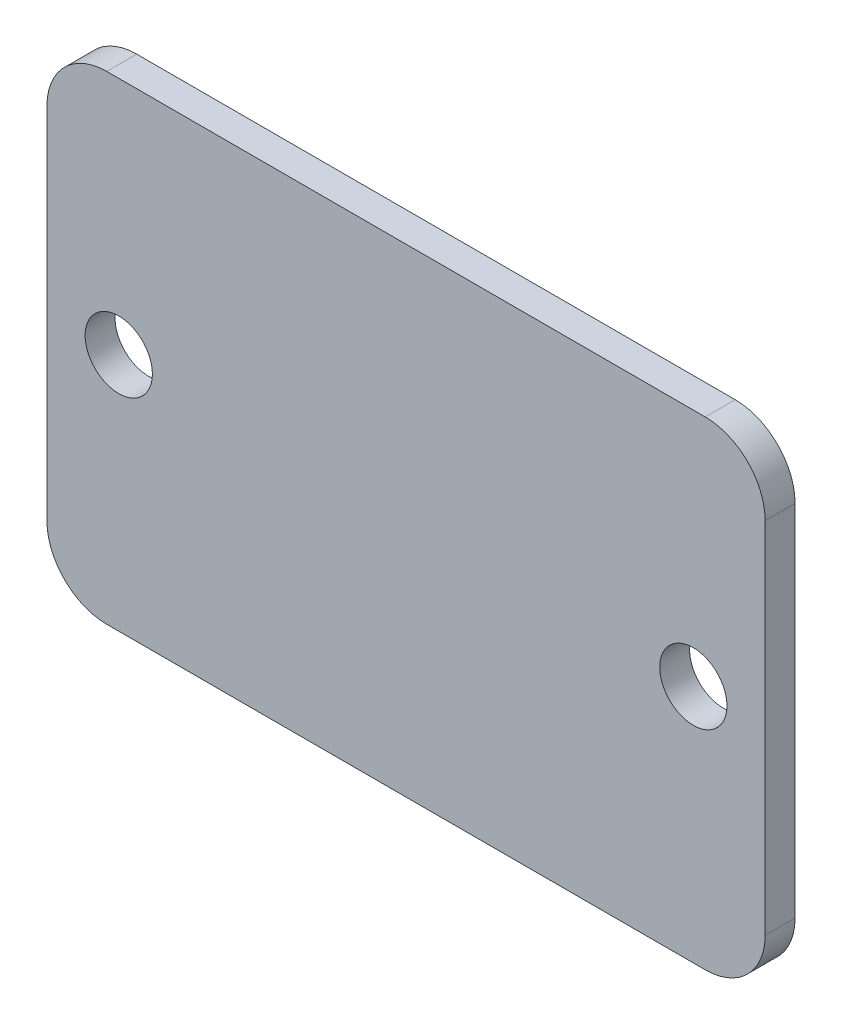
ISO-10303-21;
HEADER;
FILE_DESCRIPTION(('STEP AP214'),'2;1');
FILE_NAME('part.step','',(''),(''),'','','');
FILE_SCHEMA(('AUTOMOTIVE_DESIGN { 1 0 10303 214 1 1 1 1 }'));
ENDSEC;
DATA;
#1=APPLICATION_CONTEXT('core data for automotive mechanical design processes');
#2=APPLICATION_PROTOCOL_DEFINITION('international standard','automotive_design',2000,#1);
#3=PRODUCT_CONTEXT('',#1,'mechanical');
#4=PRODUCT('Part','Part','',(#3));
#5=PRODUCT_RELATED_PRODUCT_CATEGORY('part','',(#4));
#6=PRODUCT_DEFINITION_FORMATION('','',#4);
#7=PRODUCT_DEFINITION_CONTEXT('part definition',#1,'design');
#8=PRODUCT_DEFINITION('design','',#6,#7);
#9=PRODUCT_DEFINITION_SHAPE('','',#8);
#10=(LENGTH_UNIT() NAMED_UNIT(*) SI_UNIT(.MILLI.,.METRE.));
#11=(NAMED_UNIT(*) PLANE_ANGLE_UNIT() SI_UNIT($,.RADIAN.));
#12=(NAMED_UNIT(*) SI_UNIT($,.STERADIAN.) SOLID_ANGLE_UNIT());
#13=UNCERTAINTY_MEASURE_WITH_UNIT(LENGTH_MEASURE(1.E-05),#10,'distance_accuracy_value','');
#14=(GEOMETRIC_REPRESENTATION_CONTEXT(3) GLOBAL_UNCERTAINTY_ASSIGNED_CONTEXT((#13)) GLOBAL_UNIT_ASSIGNED_CONTEXT((#10,
#11,#12)) REPRESENTATION_CONTEXT('',''));
#15=CARTESIAN_POINT('',(0.,0.,0.));
#16=DIRECTION('',(0.,0.,1.));
#17=DIRECTION('',(1.,0.,0.));
#18=AXIS2_PLACEMENT_3D('',#15,#16,#17);
#19=CARTESIAN_POINT('',(-120.65,-132.08,0.));
#20=DIRECTION('',(0.,0.,-1.));
#21=DIRECTION('',(-1.,0.,0.));
#22=AXIS2_PLACEMENT_3D('',#19,#20,#21);
#23=PLANE('',#22);
#24=CARTESIAN_POINT('',(-182.88,-151.13,0.));
#25=DIRECTION('',(0.,0.,1.));
#26=DIRECTION('',(1.,0.,0.));
#27=AXIS2_PLACEMENT_3D('',#24,#25,#26);
#28=CIRCLE('',#27,3.5687);
#29=CARTESIAN_POINT('',(-179.3113,-151.13,0.));
#30=VERTEX_POINT('',#29);
#31=EDGE_CURVE('E228',#30,#30,#28,.T.);
#32=ORIENTED_EDGE('',*,*,#31,.T.);
#33=EDGE_LOOP('',(#32));
#34=FACE_BOUND('',#33,.T.);
#35=CARTESIAN_POINT('',(-120.65,-132.08,0.));
#36=DIRECTION('',(0.,0.,1.));
#37=DIRECTION('',(-1.,0.,0.));
#38=AXIS2_PLACEMENT_3D('',#35,#36,#37);
#39=CIRCLE('',#38,6.35);
#40=CARTESIAN_POINT('',(-114.3,-132.08,0.));
#41=VERTEX_POINT('',#40);
#42=CARTESIAN_POINT('',(-120.65,-125.73,0.));
#43=VERTEX_POINT('',#42);
#44=EDGE_CURVE('E148',#41,#43,#39,.T.);
#45=ORIENTED_EDGE('',*,*,#44,.F.);
#46=DIRECTION('',(0.,1.,0.));
#47=VECTOR('',#46,1.);
#48=CARTESIAN_POINT('',(-114.3,-132.08,0.));
#49=LINE('',#48,#47);
#50=CARTESIAN_POINT('',(-114.3,-170.18,0.));
#51=VERTEX_POINT('',#50);
#52=EDGE_CURVE('E98',#51,#41,#49,.T.);
#53=ORIENTED_EDGE('',*,*,#52,.F.);
#54=CARTESIAN_POINT('',(-120.65,-170.18,0.));
#55=DIRECTION('',(0.,0.,1.));
#56=DIRECTION('',(1.,0.,0.));
#57=AXIS2_PLACEMENT_3D('',#54,#55,#56);
#58=CIRCLE('',#57,6.35);
#59=CARTESIAN_POINT('',(-120.65,-176.53,0.));
#60=VERTEX_POINT('',#59);
#61=EDGE_CURVE('E92',#60,#51,#58,.T.);
#62=ORIENTED_EDGE('',*,*,#61,.F.);
#63=DIRECTION('',(1.,0.,0.));
#64=VECTOR('',#63,1.);
#65=CARTESIAN_POINT('',(-184.15,-176.53,0.));
#66=LINE('',#65,#64);
#67=CARTESIAN_POINT('',(-184.15,-176.53,0.));
#68=VERTEX_POINT('',#67);
#69=EDGE_CURVE('E134',#68,#60,#66,.T.);
#70=ORIENTED_EDGE('',*,*,#69,.F.);
#71=CARTESIAN_POINT('',(-184.15,-170.18,0.));
#72=DIRECTION('',(0.,0.,1.));
#73=DIRECTION('',(1.,0.,0.));
#74=AXIS2_PLACEMENT_3D('',#71,#72,#73);
#75=CIRCLE('',#74,6.35);
#76=CARTESIAN_POINT('',(-190.5,-170.18,0.));
#77=VERTEX_POINT('',#76);
#78=EDGE_CURVE('E162',#77,#68,#75,.T.);
#79=ORIENTED_EDGE('',*,*,#78,.F.);
#80=DIRECTION('',(0.,-1.,0.));
#81=VECTOR('',#80,1.);
#82=CARTESIAN_POINT('',(-190.5,-132.08,0.));
#83=LINE('',#82,#81);
#84=CARTESIAN_POINT('',(-190.5,-132.08,0.));
#85=VERTEX_POINT('',#84);
#86=EDGE_CURVE('E159',#85,#77,#83,.T.);
#87=ORIENTED_EDGE('',*,*,#86,.F.);
#88=CARTESIAN_POINT('',(-184.15,-132.08,0.));
#89=DIRECTION('',(0.,0.,1.));
#90=DIRECTION('',(1.,0.,0.));
#91=AXIS2_PLACEMENT_3D('',#88,#89,#90);
#92=CIRCLE('',#91,6.35);
#93=CARTESIAN_POINT('',(-184.15,-125.73,0.));
#94=VERTEX_POINT('',#93);
#95=EDGE_CURVE('E156',#94,#85,#92,.T.);
#96=ORIENTED_EDGE('',*,*,#95,.F.);
#97=DIRECTION('',(-1.,0.,0.));
#98=VECTOR('',#97,1.);
#99=CARTESIAN_POINT('',(-184.15,-125.73,0.));
#100=LINE('',#99,#98);
#101=EDGE_CURVE('E152',#43,#94,#100,.T.);
#102=ORIENTED_EDGE('',*,*,#101,.F.);
#103=EDGE_LOOP('',(#45,#53,#62,#70,#79,#87,#96,#102));
#104=FACE_BOUND('',#103,.T.);
#105=CARTESIAN_POINT('',(-121.92,-151.13,0.));
#106=DIRECTION('',(0.,0.,1.));
#107=DIRECTION('',(1.,0.,0.));
#108=AXIS2_PLACEMENT_3D('',#105,#106,#107);
#109=CIRCLE('',#108,3.5687);
#110=CARTESIAN_POINT('',(-118.3513,-151.13,0.));
#111=VERTEX_POINT('',#110);
#112=EDGE_CURVE('E220',#111,#111,#109,.T.);
#113=ORIENTED_EDGE('',*,*,#112,.T.);
#114=EDGE_LOOP('',(#113));
#115=FACE_BOUND('',#114,.T.);
#116=ADVANCED_FACE('F45',(#34,#104,#115),#23,.T.);
#117=CARTESIAN_POINT('',(-120.65,-132.08,3.175));
#118=DIRECTION('',(0.,0.,-1.));
#119=DIRECTION('',(-1.,0.,0.));
#120=AXIS2_PLACEMENT_3D('',#117,#118,#119);
#121=CYLINDRICAL_SURFACE('',#120,6.35);
#122=ORIENTED_EDGE('',*,*,#44,.T.);
#123=DIRECTION('',(0.,0.,-1.));
#124=VECTOR('',#123,1.);
#125=CARTESIAN_POINT('',(-120.65,-125.73,3.175));
#126=LINE('',#125,#124);
#127=CARTESIAN_POINT('',(-120.65,-125.73,3.175));
#128=VERTEX_POINT('',#127);
#129=EDGE_CURVE('E11',#128,#43,#126,.T.);
#130=ORIENTED_EDGE('',*,*,#129,.F.);
#131=CARTESIAN_POINT('',(-120.65,-132.08,3.175));
#132=DIRECTION('',(0.,0.,1.));
#133=DIRECTION('',(-1.,0.,0.));
#134=AXIS2_PLACEMENT_3D('',#131,#132,#133);
#135=CIRCLE('',#134,6.35);
#136=CARTESIAN_POINT('',(-114.3,-132.08,3.175));
#137=VERTEX_POINT('',#136);
#138=EDGE_CURVE('E171',#137,#128,#135,.T.);
#139=ORIENTED_EDGE('',*,*,#138,.F.);
#140=DIRECTION('',(0.,0.,-1.));
#141=VECTOR('',#140,1.);
#142=CARTESIAN_POINT('',(-114.3,-132.08,3.175));
#143=LINE('',#142,#141);
#144=EDGE_CURVE('E144',#137,#41,#143,.T.);
#145=ORIENTED_EDGE('',*,*,#144,.T.);
#146=EDGE_LOOP('',(#122,#130,#139,#145));
#147=FACE_BOUND('',#146,.T.);
#148=ADVANCED_FACE('F47',(#147),#121,.T.);
#149=CARTESIAN_POINT('',(-184.15,-125.73,3.175));
#150=DIRECTION('',(0.,-1.,0.));
#151=DIRECTION('',(0.,0.,-1.));
#152=AXIS2_PLACEMENT_3D('',#149,#150,#151);
#153=PLANE('',#152);
#154=ORIENTED_EDGE('',*,*,#101,.T.);
#155=DIRECTION('',(0.,0.,-1.));
#156=VECTOR('',#155,1.);
#157=CARTESIAN_POINT('',(-184.15,-125.73,3.175));
#158=LINE('',#157,#156);
#159=CARTESIAN_POINT('',(-184.15,-125.73,3.175));
#160=VERTEX_POINT('',#159);
#161=EDGE_CURVE('E55',#160,#94,#158,.T.);
#162=ORIENTED_EDGE('',*,*,#161,.F.);
#163=DIRECTION('',(-1.,0.,0.));
#164=VECTOR('',#163,1.);
#165=CARTESIAN_POINT('',(-184.15,-125.73,3.175));
#166=LINE('',#165,#164);
#167=EDGE_CURVE('E106',#128,#160,#166,.T.);
#168=ORIENTED_EDGE('',*,*,#167,.F.);
#169=ORIENTED_EDGE('',*,*,#129,.T.);
#170=EDGE_LOOP('',(#154,#162,#168,#169));
#171=FACE_BOUND('',#170,.T.);
#172=ADVANCED_FACE('F259',(#171),#153,.F.);
#173=CARTESIAN_POINT('',(-184.15,-132.08,3.175));
#174=DIRECTION('',(0.,0.,-1.));
#175=DIRECTION('',(-1.,0.,0.));
#176=AXIS2_PLACEMENT_3D('',#173,#174,#175);
#177=CYLINDRICAL_SURFACE('',#176,6.35);
#178=ORIENTED_EDGE('',*,*,#95,.T.);
#179=DIRECTION('',(0.,0.,-1.));
#180=VECTOR('',#179,1.);
#181=CARTESIAN_POINT('',(-190.5,-132.08,3.175));
#182=LINE('',#181,#180);
#183=CARTESIAN_POINT('',(-190.5,-132.08,3.175));
#184=VERTEX_POINT('',#183);
#185=EDGE_CURVE('E182',#184,#85,#182,.T.);
#186=ORIENTED_EDGE('',*,*,#185,.F.);
#187=CARTESIAN_POINT('',(-184.15,-132.08,3.175));
#188=DIRECTION('',(0.,0.,1.));
#189=DIRECTION('',(1.,0.,0.));
#190=AXIS2_PLACEMENT_3D('',#187,#188,#189);
#191=CIRCLE('',#190,6.35);
#192=EDGE_CURVE('E193',#160,#184,#191,.T.);
#193=ORIENTED_EDGE('',*,*,#192,.F.);
#194=ORIENTED_EDGE('',*,*,#161,.T.);
#195=EDGE_LOOP('',(#178,#186,#193,#194));
#196=FACE_BOUND('',#195,.T.);
#197=ADVANCED_FACE('F191',(#196),#177,.T.);
#198=CARTESIAN_POINT('',(-190.5,-132.08,3.175));
#199=DIRECTION('',(1.,0.,0.));
#200=DIRECTION('',(0.,0.,-1.));
#201=AXIS2_PLACEMENT_3D('',#198,#199,#200);
#202=PLANE('',#201);
#203=ORIENTED_EDGE('',*,*,#86,.T.);
#204=DIRECTION('',(0.,0.,-1.));
#205=VECTOR('',#204,1.);
#206=CARTESIAN_POINT('',(-190.5,-170.18,3.175));
#207=LINE('',#206,#205);
#208=CARTESIAN_POINT('',(-190.5,-170.18,3.175));
#209=VERTEX_POINT('',#208);
#210=EDGE_CURVE('E178',#209,#77,#207,.T.);
#211=ORIENTED_EDGE('',*,*,#210,.F.);
#212=DIRECTION('',(0.,-1.,0.));
#213=VECTOR('',#212,1.);
#214=CARTESIAN_POINT('',(-190.5,-132.08,3.175));
#215=LINE('',#214,#213);
#216=EDGE_CURVE('E206',#184,#209,#215,.T.);
#217=ORIENTED_EDGE('',*,*,#216,.F.);
#218=ORIENTED_EDGE('',*,*,#185,.T.);
#219=EDGE_LOOP('',(#203,#211,#217,#218));
#220=FACE_BOUND('',#219,.T.);
#221=ADVANCED_FACE('F201',(#220),#202,.F.);
#222=CARTESIAN_POINT('',(-184.15,-170.18,3.175));
#223=DIRECTION('',(0.,0.,-1.));
#224=DIRECTION('',(-1.,0.,0.));
#225=AXIS2_PLACEMENT_3D('',#222,#223,#224);
#226=CYLINDRICAL_SURFACE('',#225,6.35);
#227=ORIENTED_EDGE('',*,*,#78,.T.);
#228=DIRECTION('',(0.,0.,-1.));
#229=VECTOR('',#228,1.);
#230=CARTESIAN_POINT('',(-184.15,-176.53,3.175));
#231=LINE('',#230,#229);
#232=CARTESIAN_POINT('',(-184.15,-176.53,3.175));
#233=VERTEX_POINT('',#232);
#234=EDGE_CURVE('E136',#233,#68,#231,.T.);
#235=ORIENTED_EDGE('',*,*,#234,.F.);
#236=CARTESIAN_POINT('',(-184.15,-170.18,3.175));
#237=DIRECTION('',(0.,0.,1.));
#238=DIRECTION('',(1.,0.,0.));
#239=AXIS2_PLACEMENT_3D('',#236,#237,#238);
#240=CIRCLE('',#239,6.35);
#241=EDGE_CURVE('E125',#209,#233,#240,.T.);
#242=ORIENTED_EDGE('',*,*,#241,.F.);
#243=ORIENTED_EDGE('',*,*,#210,.T.);
#244=EDGE_LOOP('',(#227,#235,#242,#243));
#245=FACE_BOUND('',#244,.T.);
#246=ADVANCED_FACE('F204',(#245),#226,.T.);
#247=CARTESIAN_POINT('',(-184.15,-176.53,3.175));
#248=DIRECTION('',(0.,1.,0.));
#249=DIRECTION('',(-1.,0.,0.));
#250=AXIS2_PLACEMENT_3D('',#247,#248,#249);
#251=PLANE('',#250);
#252=ORIENTED_EDGE('',*,*,#69,.T.);
#253=DIRECTION('',(0.,0.,-1.));
#254=VECTOR('',#253,1.);
#255=CARTESIAN_POINT('',(-120.65,-176.53,3.175));
#256=LINE('',#255,#254);
#257=CARTESIAN_POINT('',(-120.65,-176.53,3.175));
#258=VERTEX_POINT('',#257);
#259=EDGE_CURVE('E131',#258,#60,#256,.T.);
#260=ORIENTED_EDGE('',*,*,#259,.F.);
#261=DIRECTION('',(1.,0.,0.));
#262=VECTOR('',#261,1.);
#263=CARTESIAN_POINT('',(-184.15,-176.53,3.175));
#264=LINE('',#263,#262);
#265=EDGE_CURVE('E119',#233,#258,#264,.T.);
#266=ORIENTED_EDGE('',*,*,#265,.F.);
#267=ORIENTED_EDGE('',*,*,#234,.T.);
#268=EDGE_LOOP('',(#252,#260,#266,#267));
#269=FACE_BOUND('',#268,.T.);
#270=ADVANCED_FACE('F132',(#269),#251,.F.);
#271=CARTESIAN_POINT('',(-120.65,-170.18,3.175));
#272=DIRECTION('',(0.,0.,-1.));
#273=DIRECTION('',(-1.,0.,0.));
#274=AXIS2_PLACEMENT_3D('',#271,#272,#273);
#275=CYLINDRICAL_SURFACE('',#274,6.35);
#276=ORIENTED_EDGE('',*,*,#61,.T.);
#277=DIRECTION('',(0.,0.,-1.));
#278=VECTOR('',#277,1.);
#279=CARTESIAN_POINT('',(-114.3,-170.18,3.175));
#280=LINE('',#279,#278);
#281=CARTESIAN_POINT('',(-114.3,-170.18,3.175));
#282=VERTEX_POINT('',#281);
#283=EDGE_CURVE('E137',#282,#51,#280,.T.);
#284=ORIENTED_EDGE('',*,*,#283,.F.);
#285=CARTESIAN_POINT('',(-120.65,-170.18,3.175));
#286=DIRECTION('',(0.,0.,1.));
#287=DIRECTION('',(1.,0.,0.));
#288=AXIS2_PLACEMENT_3D('',#285,#286,#287);
#289=CIRCLE('',#288,6.35);
#290=EDGE_CURVE('E123',#258,#282,#289,.T.);
#291=ORIENTED_EDGE('',*,*,#290,.F.);
#292=ORIENTED_EDGE('',*,*,#259,.T.);
#293=EDGE_LOOP('',(#276,#284,#291,#292));
#294=FACE_BOUND('',#293,.T.);
#295=ADVANCED_FACE('F139',(#294),#275,.T.);
#296=CARTESIAN_POINT('',(-114.3,-132.08,3.175));
#297=DIRECTION('',(-1.,0.,0.));
#298=DIRECTION('',(0.,-1.,0.));
#299=AXIS2_PLACEMENT_3D('',#296,#297,#298);
#300=PLANE('',#299);
#301=ORIENTED_EDGE('',*,*,#52,.T.);
#302=ORIENTED_EDGE('',*,*,#144,.F.);
#303=DIRECTION('',(0.,1.,0.));
#304=VECTOR('',#303,1.);
#305=CARTESIAN_POINT('',(-114.3,-132.08,3.175));
#306=LINE('',#305,#304);
#307=EDGE_CURVE('E63',#282,#137,#306,.T.);
#308=ORIENTED_EDGE('',*,*,#307,.F.);
#309=ORIENTED_EDGE('',*,*,#283,.T.);
#310=EDGE_LOOP('',(#301,#302,#308,#309));
#311=FACE_BOUND('',#310,.T.);
#312=ADVANCED_FACE('F244',(#311),#300,.F.);
#313=CARTESIAN_POINT('',(-120.65,-132.08,3.175));
#314=DIRECTION('',(0.,0.,-1.));
#315=DIRECTION('',(-1.,0.,0.));
#316=AXIS2_PLACEMENT_3D('',#313,#314,#315);
#317=PLANE('',#316);
#318=CARTESIAN_POINT('',(-182.88,-151.13,3.175));
#319=DIRECTION('',(0.,0.,1.));
#320=DIRECTION('',(1.,0.,0.));
#321=AXIS2_PLACEMENT_3D('',#318,#319,#320);
#322=CIRCLE('',#321,3.5687);
#323=CARTESIAN_POINT('',(-179.3113,-151.13,3.175));
#324=VERTEX_POINT('',#323);
#325=EDGE_CURVE('E224',#324,#324,#322,.T.);
#326=ORIENTED_EDGE('',*,*,#325,.F.);
#327=EDGE_LOOP('',(#326));
#328=FACE_BOUND('',#327,.T.);
#329=CARTESIAN_POINT('',(-121.92,-151.13,3.175));
#330=DIRECTION('',(0.,0.,1.));
#331=DIRECTION('',(1.,0.,0.));
#332=AXIS2_PLACEMENT_3D('',#329,#330,#331);
#333=CIRCLE('',#332,3.5687);
#334=CARTESIAN_POINT('',(-118.3513,-151.13,3.175));
#335=VERTEX_POINT('',#334);
#336=EDGE_CURVE('E153',#335,#335,#333,.T.);
#337=ORIENTED_EDGE('',*,*,#336,.F.);
#338=EDGE_LOOP('',(#337));
#339=FACE_BOUND('',#338,.T.);
#340=ORIENTED_EDGE('',*,*,#138,.T.);
#341=ORIENTED_EDGE('',*,*,#167,.T.);
#342=ORIENTED_EDGE('',*,*,#192,.T.);
#343=ORIENTED_EDGE('',*,*,#216,.T.);
#344=ORIENTED_EDGE('',*,*,#241,.T.);
#345=ORIENTED_EDGE('',*,*,#265,.T.);
#346=ORIENTED_EDGE('',*,*,#290,.T.);
#347=ORIENTED_EDGE('',*,*,#307,.T.);
#348=EDGE_LOOP('',(#340,#341,#342,#343,#344,#345,#346,#347));
#349=FACE_BOUND('',#348,.T.);
#350=ADVANCED_FACE('F121',(#328,#339,#349),#317,.F.);
#351=CARTESIAN_POINT('',(-121.92,-151.13,3.175));
#352=DIRECTION('',(0.,0.,1.));
#353=DIRECTION('',(1.,0.,0.));
#354=AXIS2_PLACEMENT_3D('',#351,#352,#353);
#355=CYLINDRICAL_SURFACE('',#354,3.5687);
#356=ORIENTED_EDGE('',*,*,#112,.F.);
#357=EDGE_LOOP('',(#356));
#358=FACE_BOUND('',#357,.T.);
#359=ORIENTED_EDGE('',*,*,#336,.T.);
#360=EDGE_LOOP('',(#359));
#361=FACE_BOUND('',#360,.T.);
#362=ADVANCED_FACE('F238',(#358,#361),#355,.F.);
#363=CARTESIAN_POINT('',(-182.88,-151.13,3.175));
#364=DIRECTION('',(0.,0.,1.));
#365=DIRECTION('',(1.,0.,0.));
#366=AXIS2_PLACEMENT_3D('',#363,#364,#365);
#367=CYLINDRICAL_SURFACE('',#366,3.5687);
#368=ORIENTED_EDGE('',*,*,#31,.F.);
#369=EDGE_LOOP('',(#368));
#370=FACE_BOUND('',#369,.T.);
#371=ORIENTED_EDGE('',*,*,#325,.T.);
#372=EDGE_LOOP('',(#371));
#373=FACE_BOUND('',#372,.T.);
#374=ADVANCED_FACE('F235',(#370,#373),#367,.F.);
#375=CLOSED_SHELL('',(#116,#148,#172,#197,#221,#246,#270,#295,#312,#350,#362,#374));
#376=MANIFOLD_SOLID_BREP('B2',#375);
#377=ADVANCED_BREP_SHAPE_REPRESENTATION('',(#18,#376),#14);
#378=SHAPE_DEFINITION_REPRESENTATION(#9,#377);
ENDSEC;
END-ISO-10303-21;
